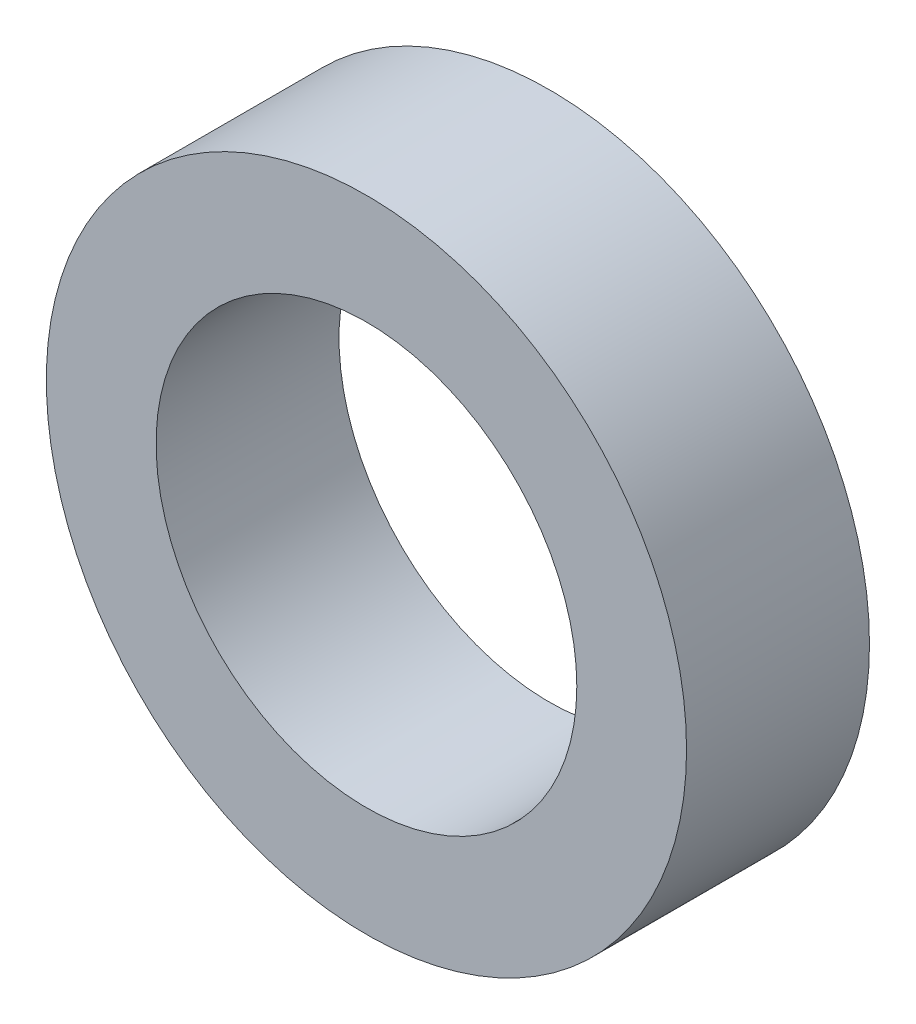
ISO-10303-21;
HEADER;
FILE_DESCRIPTION(('STEP AP214'),'2;1');
FILE_NAME('part.step','',(''),(''),'','','');
FILE_SCHEMA(('AUTOMOTIVE_DESIGN { 1 0 10303 214 1 1 1 1 }'));
ENDSEC;
DATA;
#1=APPLICATION_CONTEXT('core data for automotive mechanical design processes');
#2=APPLICATION_PROTOCOL_DEFINITION('international standard','automotive_design',2000,#1);
#3=PRODUCT_CONTEXT('',#1,'mechanical');
#4=PRODUCT('Part','Part','',(#3));
#5=PRODUCT_RELATED_PRODUCT_CATEGORY('part','',(#4));
#6=PRODUCT_DEFINITION_FORMATION('','',#4);
#7=PRODUCT_DEFINITION_CONTEXT('part definition',#1,'design');
#8=PRODUCT_DEFINITION('design','',#6,#7);
#9=PRODUCT_DEFINITION_SHAPE('','',#8);
#10=(LENGTH_UNIT() NAMED_UNIT(*) SI_UNIT(.MILLI.,.METRE.));
#11=(NAMED_UNIT(*) PLANE_ANGLE_UNIT() SI_UNIT($,.RADIAN.));
#12=(NAMED_UNIT(*) SI_UNIT($,.STERADIAN.) SOLID_ANGLE_UNIT());
#13=UNCERTAINTY_MEASURE_WITH_UNIT(LENGTH_MEASURE(1.E-05),#10,'distance_accuracy_value','');
#14=(GEOMETRIC_REPRESENTATION_CONTEXT(3) GLOBAL_UNCERTAINTY_ASSIGNED_CONTEXT((#13)) GLOBAL_UNIT_ASSIGNED_CONTEXT((#10,
#11,#12)) REPRESENTATION_CONTEXT('',''));
#15=CARTESIAN_POINT('',(0.,0.,0.));
#16=DIRECTION('',(0.,0.,1.));
#17=DIRECTION('',(1.,0.,0.));
#18=AXIS2_PLACEMENT_3D('',#15,#16,#17);
#19=CARTESIAN_POINT('',(0.,0.,12.7));
#20=DIRECTION('',(0.,0.,1.));
#21=DIRECTION('',(1.,0.,0.));
#22=AXIS2_PLACEMENT_3D('',#19,#20,#21);
#23=PLANE('',#22);
#24=CARTESIAN_POINT('',(0.,0.,12.7));
#25=DIRECTION('',(0.,0.,1.));
#26=DIRECTION('',(1.,0.,0.));
#27=AXIS2_PLACEMENT_3D('',#24,#25,#26);
#28=CIRCLE('',#27,44.4499615);
#29=CARTESIAN_POINT('',(44.4499615,0.,12.7));
#30=VERTEX_POINT('',#29);
#31=EDGE_CURVE('E10',#30,#30,#28,.T.);
#32=ORIENTED_EDGE('',*,*,#31,.T.);
#33=EDGE_LOOP('',(#32));
#34=FACE_BOUND('',#33,.T.);
#35=CARTESIAN_POINT('',(0.,0.,12.7));
#36=DIRECTION('',(0.,0.,1.));
#37=DIRECTION('',(1.,0.,0.));
#38=AXIS2_PLACEMENT_3D('',#35,#36,#37);
#39=CIRCLE('',#38,29.21);
#40=CARTESIAN_POINT('',(29.21,0.,12.7));
#41=VERTEX_POINT('',#40);
#42=EDGE_CURVE('E41',#41,#41,#39,.T.);
#43=ORIENTED_EDGE('',*,*,#42,.F.);
#44=EDGE_LOOP('',(#43));
#45=FACE_BOUND('',#44,.T.);
#46=ADVANCED_FACE('F30',(#34,#45),#23,.T.);
#47=CARTESIAN_POINT('',(0.,0.,-12.7));
#48=DIRECTION('',(0.,0.,1.));
#49=DIRECTION('',(1.,0.,0.));
#50=AXIS2_PLACEMENT_3D('',#47,#48,#49);
#51=PLANE('',#50);
#52=CARTESIAN_POINT('',(0.,0.,-12.7));
#53=DIRECTION('',(0.,0.,1.));
#54=DIRECTION('',(1.,0.,0.));
#55=AXIS2_PLACEMENT_3D('',#52,#53,#54);
#56=CIRCLE('',#55,44.4499615);
#57=CARTESIAN_POINT('',(44.4499615,0.,-12.7));
#58=VERTEX_POINT('',#57);
#59=EDGE_CURVE('E34',#58,#58,#56,.T.);
#60=ORIENTED_EDGE('',*,*,#59,.F.);
#61=EDGE_LOOP('',(#60));
#62=FACE_BOUND('',#61,.T.);
#63=CARTESIAN_POINT('',(0.,0.,-12.7));
#64=DIRECTION('',(0.,0.,1.));
#65=DIRECTION('',(1.,0.,0.));
#66=AXIS2_PLACEMENT_3D('',#63,#64,#65);
#67=CIRCLE('',#66,29.21);
#68=CARTESIAN_POINT('',(29.21,0.,-12.7));
#69=VERTEX_POINT('',#68);
#70=EDGE_CURVE('E43',#69,#69,#67,.T.);
#71=ORIENTED_EDGE('',*,*,#70,.T.);
#72=EDGE_LOOP('',(#71));
#73=FACE_BOUND('',#72,.T.);
#74=ADVANCED_FACE('F53',(#62,#73),#51,.F.);
#75=CARTESIAN_POINT('',(0.,0.,12.7));
#76=DIRECTION('',(0.,0.,-1.));
#77=DIRECTION('',(-1.,0.,0.));
#78=AXIS2_PLACEMENT_3D('',#75,#76,#77);
#79=CYLINDRICAL_SURFACE('',#78,44.4499615);
#80=ORIENTED_EDGE('',*,*,#31,.F.);
#81=EDGE_LOOP('',(#80));
#82=FACE_BOUND('',#81,.T.);
#83=ORIENTED_EDGE('',*,*,#59,.T.);
#84=EDGE_LOOP('',(#83));
#85=FACE_BOUND('',#84,.T.);
#86=ADVANCED_FACE('F32',(#82,#85),#79,.T.);
#87=CARTESIAN_POINT('',(0.,0.,12.7));
#88=DIRECTION('',(0.,0.,-1.));
#89=DIRECTION('',(-1.,0.,0.));
#90=AXIS2_PLACEMENT_3D('',#87,#88,#89);
#91=CYLINDRICAL_SURFACE('',#90,29.21);
#92=ORIENTED_EDGE('',*,*,#42,.T.);
#93=EDGE_LOOP('',(#92));
#94=FACE_BOUND('',#93,.T.);
#95=ORIENTED_EDGE('',*,*,#70,.F.);
#96=EDGE_LOOP('',(#95));
#97=FACE_BOUND('',#96,.T.);
#98=ADVANCED_FACE('F49',(#94,#97),#91,.F.);
#99=CLOSED_SHELL('',(#46,#74,#86,#98));
#100=MANIFOLD_SOLID_BREP('B2',#99);
#101=ADVANCED_BREP_SHAPE_REPRESENTATION('',(#18,#100),#14);
#102=SHAPE_DEFINITION_REPRESENTATION(#9,#101);
ENDSEC;
END-ISO-10303-21;
